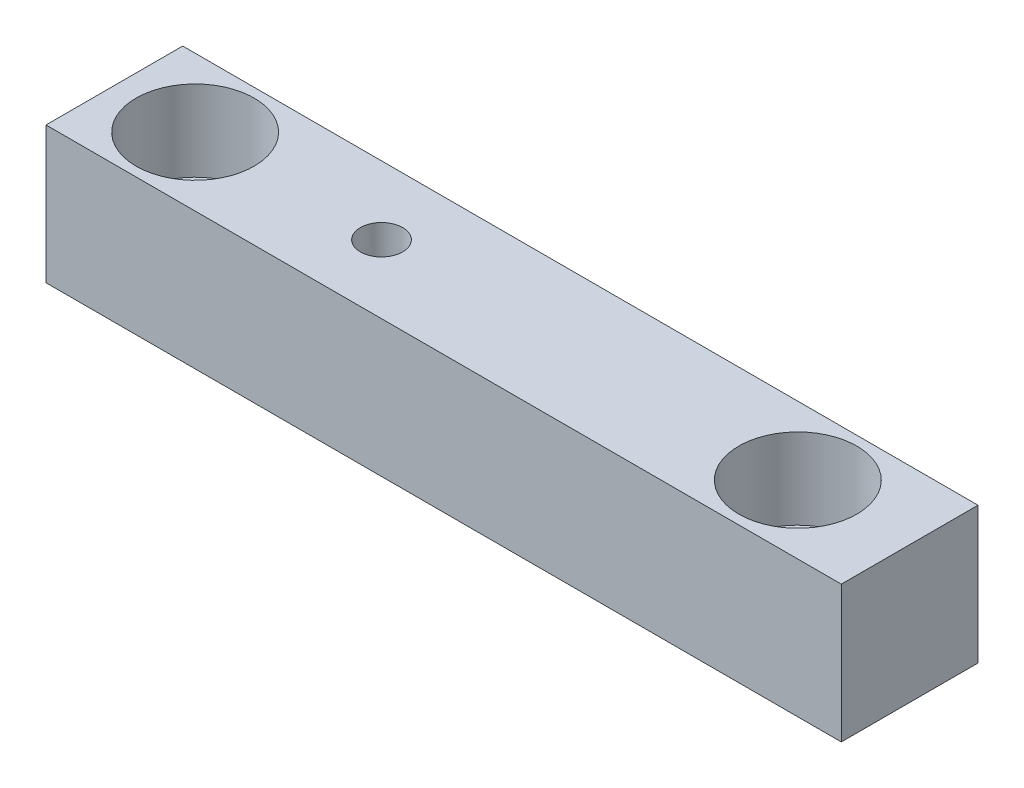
ISO-10303-21;
HEADER;
FILE_DESCRIPTION(('STEP AP214'),'2;1');
FILE_NAME('part.step','',(''),(''),'','','');
FILE_SCHEMA(('AUTOMOTIVE_DESIGN { 1 0 10303 214 1 1 1 1 }'));
ENDSEC;
DATA;
#1=APPLICATION_CONTEXT('core data for automotive mechanical design processes');
#2=APPLICATION_PROTOCOL_DEFINITION('international standard','automotive_design',2000,#1);
#3=PRODUCT_CONTEXT('',#1,'mechanical');
#4=PRODUCT('Part','Part','',(#3));
#5=PRODUCT_RELATED_PRODUCT_CATEGORY('part','',(#4));
#6=PRODUCT_DEFINITION_FORMATION('','',#4);
#7=PRODUCT_DEFINITION_CONTEXT('part definition',#1,'design');
#8=PRODUCT_DEFINITION('design','',#6,#7);
#9=PRODUCT_DEFINITION_SHAPE('','',#8);
#10=(LENGTH_UNIT() NAMED_UNIT(*) SI_UNIT(.MILLI.,.METRE.));
#11=(NAMED_UNIT(*) PLANE_ANGLE_UNIT() SI_UNIT($,.RADIAN.));
#12=(NAMED_UNIT(*) SI_UNIT($,.STERADIAN.) SOLID_ANGLE_UNIT());
#13=UNCERTAINTY_MEASURE_WITH_UNIT(LENGTH_MEASURE(1.E-05),#10,'distance_accuracy_value','');
#14=(GEOMETRIC_REPRESENTATION_CONTEXT(3) GLOBAL_UNCERTAINTY_ASSIGNED_CONTEXT((#13)) GLOBAL_UNIT_ASSIGNED_CONTEXT((#10,
#11,#12)) REPRESENTATION_CONTEXT('',''));
#15=CARTESIAN_POINT('',(0.,0.,0.));
#16=DIRECTION('',(0.,0.,1.));
#17=DIRECTION('',(1.,0.,0.));
#18=AXIS2_PLACEMENT_3D('',#15,#16,#17);
#19=CARTESIAN_POINT('',(110.,0.,11.));
#20=DIRECTION('',(0.,1.,0.));
#21=DIRECTION('',(0.,0.,1.));
#22=AXIS2_PLACEMENT_3D('',#19,#20,#21);
#23=CYLINDRICAL_SURFACE('',#22,6.25);
#24=CARTESIAN_POINT('',(110.,0.,11.));
#25=DIRECTION('',(0.,1.,0.));
#26=DIRECTION('',(0.,0.,1.));
#27=AXIS2_PLACEMENT_3D('',#24,#25,#26);
#28=CIRCLE('',#27,6.25);
#29=CARTESIAN_POINT('',(110.,0.,17.25));
#30=VERTEX_POINT('',#29);
#31=EDGE_CURVE('E114',#30,#30,#28,.T.);
#32=ORIENTED_EDGE('',*,*,#31,.F.);
#33=EDGE_LOOP('',(#32));
#34=FACE_BOUND('',#33,.T.);
#35=CARTESIAN_POINT('',(110.,9.,11.));
#36=DIRECTION('',(0.,1.,0.));
#37=DIRECTION('',(0.,0.,1.));
#38=AXIS2_PLACEMENT_3D('',#35,#36,#37);
#39=CIRCLE('',#38,6.25);
#40=CARTESIAN_POINT('',(110.,9.,17.25));
#41=VERTEX_POINT('',#40);
#42=EDGE_CURVE('E41',#41,#41,#39,.F.);
#43=ORIENTED_EDGE('',*,*,#42,.F.);
#44=EDGE_LOOP('',(#43));
#45=FACE_BOUND('',#44,.T.);
#46=ADVANCED_FACE('F37',(#34,#45),#23,.F.);
#47=CARTESIAN_POINT('',(13.,0.,11.));
#48=DIRECTION('',(0.,1.,0.));
#49=DIRECTION('',(0.,0.,1.));
#50=AXIS2_PLACEMENT_3D('',#47,#48,#49);
#51=CYLINDRICAL_SURFACE('',#50,6.25);
#52=CARTESIAN_POINT('',(13.,0.,11.));
#53=DIRECTION('',(0.,1.,0.));
#54=DIRECTION('',(0.,0.,1.));
#55=AXIS2_PLACEMENT_3D('',#52,#53,#54);
#56=CIRCLE('',#55,6.25);
#57=CARTESIAN_POINT('',(13.,0.,17.25));
#58=VERTEX_POINT('',#57);
#59=EDGE_CURVE('E107',#58,#58,#56,.T.);
#60=ORIENTED_EDGE('',*,*,#59,.F.);
#61=EDGE_LOOP('',(#60));
#62=FACE_BOUND('',#61,.T.);
#63=CARTESIAN_POINT('',(13.,9.,11.));
#64=DIRECTION('',(0.,1.,0.));
#65=DIRECTION('',(0.,0.,1.));
#66=AXIS2_PLACEMENT_3D('',#63,#64,#65);
#67=CIRCLE('',#66,6.25);
#68=CARTESIAN_POINT('',(13.,9.,17.25));
#69=VERTEX_POINT('',#68);
#70=EDGE_CURVE('E112',#69,#69,#67,.F.);
#71=ORIENTED_EDGE('',*,*,#70,.F.);
#72=EDGE_LOOP('',(#71));
#73=FACE_BOUND('',#72,.T.);
#74=ADVANCED_FACE('F135',(#62,#73),#51,.F.);
#75=CARTESIAN_POINT('',(0.,0.,22.));
#76=DIRECTION('',(1.,0.,0.));
#77=DIRECTION('',(0.,0.,-1.));
#78=AXIS2_PLACEMENT_3D('',#75,#76,#77);
#79=PLANE('',#78);
#80=DIRECTION('',(0.,-1.,0.));
#81=VECTOR('',#80,1.);
#82=CARTESIAN_POINT('',(0.,0.,0.));
#83=LINE('',#82,#81);
#84=CARTESIAN_POINT('',(0.,22.,0.));
#85=VERTEX_POINT('',#84);
#86=CARTESIAN_POINT('',(0.,0.,0.));
#87=VERTEX_POINT('',#86);
#88=EDGE_CURVE('E104',#85,#87,#83,.T.);
#89=ORIENTED_EDGE('',*,*,#88,.T.);
#90=DIRECTION('',(0.,0.,-1.));
#91=VECTOR('',#90,1.);
#92=CARTESIAN_POINT('',(0.,0.,22.));
#93=LINE('',#92,#91);
#94=CARTESIAN_POINT('',(0.,0.,22.));
#95=VERTEX_POINT('',#94);
#96=EDGE_CURVE('E11',#95,#87,#93,.T.);
#97=ORIENTED_EDGE('',*,*,#96,.F.);
#98=DIRECTION('',(0.,-1.,0.));
#99=VECTOR('',#98,1.);
#100=CARTESIAN_POINT('',(0.,0.,22.));
#101=LINE('',#100,#99);
#102=CARTESIAN_POINT('',(0.,22.,22.));
#103=VERTEX_POINT('',#102);
#104=EDGE_CURVE('E91',#103,#95,#101,.T.);
#105=ORIENTED_EDGE('',*,*,#104,.F.);
#106=DIRECTION('',(0.,0.,-1.));
#107=VECTOR('',#106,1.);
#108=CARTESIAN_POINT('',(0.,22.,22.));
#109=LINE('',#108,#107);
#110=EDGE_CURVE('E100',#103,#85,#109,.T.);
#111=ORIENTED_EDGE('',*,*,#110,.T.);
#112=EDGE_LOOP('',(#89,#97,#105,#111));
#113=FACE_BOUND('',#112,.T.);
#114=ADVANCED_FACE('F39',(#113),#79,.F.);
#115=CARTESIAN_POINT('',(0.,0.,22.));
#116=DIRECTION('',(0.,1.,0.));
#117=DIRECTION('',(0.,0.,1.));
#118=AXIS2_PLACEMENT_3D('',#115,#116,#117);
#119=PLANE('',#118);
#120=CARTESIAN_POINT('',(43.,0.,11.));
#121=DIRECTION('',(0.,1.,0.));
#122=DIRECTION('',(0.,0.,1.));
#123=AXIS2_PLACEMENT_3D('',#120,#121,#122);
#124=CIRCLE('',#123,3.39999999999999);
#125=CARTESIAN_POINT('',(43.,0.,14.4));
#126=VERTEX_POINT('',#125);
#127=EDGE_CURVE('E167',#126,#126,#124,.T.);
#128=ORIENTED_EDGE('',*,*,#127,.T.);
#129=EDGE_LOOP('',(#128));
#130=FACE_BOUND('',#129,.T.);
#131=ORIENTED_EDGE('',*,*,#31,.T.);
#132=EDGE_LOOP('',(#131));
#133=FACE_BOUND('',#132,.T.);
#134=ORIENTED_EDGE('',*,*,#59,.T.);
#135=EDGE_LOOP('',(#134));
#136=FACE_BOUND('',#135,.T.);
#137=DIRECTION('',(1.,0.,0.));
#138=VECTOR('',#137,1.);
#139=CARTESIAN_POINT('',(0.,0.,0.));
#140=LINE('',#139,#138);
#141=CARTESIAN_POINT('',(128.,0.,0.));
#142=VERTEX_POINT('',#141);
#143=EDGE_CURVE('E95',#87,#142,#140,.T.);
#144=ORIENTED_EDGE('',*,*,#143,.T.);
#145=DIRECTION('',(0.,0.,-1.));
#146=VECTOR('',#145,1.);
#147=CARTESIAN_POINT('',(128.,0.,22.));
#148=LINE('',#147,#146);
#149=CARTESIAN_POINT('',(128.,0.,22.));
#150=VERTEX_POINT('',#149);
#151=EDGE_CURVE('E47',#150,#142,#148,.T.);
#152=ORIENTED_EDGE('',*,*,#151,.F.);
#153=DIRECTION('',(1.,0.,0.));
#154=VECTOR('',#153,1.);
#155=CARTESIAN_POINT('',(0.,0.,22.));
#156=LINE('',#155,#154);
#157=EDGE_CURVE('E86',#95,#150,#156,.T.);
#158=ORIENTED_EDGE('',*,*,#157,.F.);
#159=ORIENTED_EDGE('',*,*,#96,.T.);
#160=EDGE_LOOP('',(#144,#152,#158,#159));
#161=FACE_BOUND('',#160,.T.);
#162=ADVANCED_FACE('F94',(#130,#133,#136,#161),#119,.F.);
#163=CARTESIAN_POINT('',(128.,0.,22.));
#164=DIRECTION('',(-1.,0.,0.));
#165=DIRECTION('',(0.,0.,1.));
#166=AXIS2_PLACEMENT_3D('',#163,#164,#165);
#167=PLANE('',#166);
#168=DIRECTION('',(0.,1.,0.));
#169=VECTOR('',#168,1.);
#170=CARTESIAN_POINT('',(128.,0.,0.));
#171=LINE('',#170,#169);
#172=CARTESIAN_POINT('',(128.,22.,0.));
#173=VERTEX_POINT('',#172);
#174=EDGE_CURVE('E73',#142,#173,#171,.T.);
#175=ORIENTED_EDGE('',*,*,#174,.T.);
#176=DIRECTION('',(0.,0.,-1.));
#177=VECTOR('',#176,1.);
#178=CARTESIAN_POINT('',(128.,22.,22.));
#179=LINE('',#178,#177);
#180=CARTESIAN_POINT('',(128.,22.,22.));
#181=VERTEX_POINT('',#180);
#182=EDGE_CURVE('E96',#181,#173,#179,.T.);
#183=ORIENTED_EDGE('',*,*,#182,.F.);
#184=DIRECTION('',(0.,1.,0.));
#185=VECTOR('',#184,1.);
#186=CARTESIAN_POINT('',(128.,0.,22.));
#187=LINE('',#186,#185);
#188=EDGE_CURVE('E89',#150,#181,#187,.T.);
#189=ORIENTED_EDGE('',*,*,#188,.F.);
#190=ORIENTED_EDGE('',*,*,#151,.T.);
#191=EDGE_LOOP('',(#175,#183,#189,#190));
#192=FACE_BOUND('',#191,.T.);
#193=ADVANCED_FACE('F98',(#192),#167,.F.);
#194=CARTESIAN_POINT('',(0.,22.,22.));
#195=DIRECTION('',(0.,-1.,0.));
#196=DIRECTION('',(0.,0.,-1.));
#197=AXIS2_PLACEMENT_3D('',#194,#195,#196);
#198=PLANE('',#197);
#199=CARTESIAN_POINT('',(43.,22.,11.));
#200=DIRECTION('',(0.,1.,0.));
#201=DIRECTION('',(0.,0.,1.));
#202=AXIS2_PLACEMENT_3D('',#199,#200,#201);
#203=CIRCLE('',#202,3.4);
#204=CARTESIAN_POINT('',(43.,22.,14.4));
#205=VERTEX_POINT('',#204);
#206=EDGE_CURVE('E180',#205,#205,#203,.T.);
#207=ORIENTED_EDGE('',*,*,#206,.F.);
#208=EDGE_LOOP('',(#207));
#209=FACE_BOUND('',#208,.T.);
#210=CARTESIAN_POINT('',(110.,22.,11.));
#211=DIRECTION('',(0.,1.,0.));
#212=DIRECTION('',(0.,0.,1.));
#213=AXIS2_PLACEMENT_3D('',#210,#211,#212);
#214=CIRCLE('',#213,9.5);
#215=CARTESIAN_POINT('',(110.,22.,20.5));
#216=VERTEX_POINT('',#215);
#217=EDGE_CURVE('E128',#216,#216,#214,.T.);
#218=ORIENTED_EDGE('',*,*,#217,.F.);
#219=EDGE_LOOP('',(#218));
#220=FACE_BOUND('',#219,.T.);
#221=CARTESIAN_POINT('',(13.,22.,11.));
#222=DIRECTION('',(0.,1.,0.));
#223=DIRECTION('',(0.,0.,1.));
#224=AXIS2_PLACEMENT_3D('',#221,#222,#223);
#225=CIRCLE('',#224,9.5);
#226=CARTESIAN_POINT('',(13.,22.,20.5));
#227=VERTEX_POINT('',#226);
#228=EDGE_CURVE('E121',#227,#227,#225,.T.);
#229=ORIENTED_EDGE('',*,*,#228,.F.);
#230=EDGE_LOOP('',(#229));
#231=FACE_BOUND('',#230,.T.);
#232=DIRECTION('',(-1.,0.,0.));
#233=VECTOR('',#232,1.);
#234=CARTESIAN_POINT('',(0.,22.,0.));
#235=LINE('',#234,#233);
#236=EDGE_CURVE('E79',#173,#85,#235,.T.);
#237=ORIENTED_EDGE('',*,*,#236,.T.);
#238=ORIENTED_EDGE('',*,*,#110,.F.);
#239=DIRECTION('',(-1.,0.,0.));
#240=VECTOR('',#239,1.);
#241=CARTESIAN_POINT('',(0.,22.,22.));
#242=LINE('',#241,#240);
#243=EDGE_CURVE('E56',#181,#103,#242,.T.);
#244=ORIENTED_EDGE('',*,*,#243,.F.);
#245=ORIENTED_EDGE('',*,*,#182,.T.);
#246=EDGE_LOOP('',(#237,#238,#244,#245));
#247=FACE_BOUND('',#246,.T.);
#248=ADVANCED_FACE('F151',(#209,#220,#231,#247),#198,.F.);
#249=CARTESIAN_POINT('',(0.,0.,22.));
#250=DIRECTION('',(0.,0.,-1.));
#251=DIRECTION('',(-1.,0.,0.));
#252=AXIS2_PLACEMENT_3D('',#249,#250,#251);
#253=PLANE('',#252);
#254=ORIENTED_EDGE('',*,*,#104,.T.);
#255=ORIENTED_EDGE('',*,*,#157,.T.);
#256=ORIENTED_EDGE('',*,*,#188,.T.);
#257=ORIENTED_EDGE('',*,*,#243,.T.);
#258=EDGE_LOOP('',(#254,#255,#256,#257));
#259=FACE_BOUND('',#258,.T.);
#260=ADVANCED_FACE('F87',(#259),#253,.F.);
#261=CARTESIAN_POINT('',(0.,0.,0.));
#262=DIRECTION('',(0.,0.,-1.));
#263=DIRECTION('',(-1.,0.,0.));
#264=AXIS2_PLACEMENT_3D('',#261,#262,#263);
#265=PLANE('',#264);
#266=ORIENTED_EDGE('',*,*,#88,.F.);
#267=ORIENTED_EDGE('',*,*,#236,.F.);
#268=ORIENTED_EDGE('',*,*,#174,.F.);
#269=ORIENTED_EDGE('',*,*,#143,.F.);
#270=EDGE_LOOP('',(#266,#267,#268,#269));
#271=FACE_BOUND('',#270,.T.);
#272=ADVANCED_FACE('F150',(#271),#265,.T.);
#273=CARTESIAN_POINT('',(13.,9.,11.));
#274=DIRECTION('',(0.,1.,0.));
#275=DIRECTION('',(0.,0.,1.));
#276=AXIS2_PLACEMENT_3D('',#273,#274,#275);
#277=PLANE('',#276);
#278=CARTESIAN_POINT('',(13.,9.,11.));
#279=DIRECTION('',(0.,1.,0.));
#280=DIRECTION('',(0.,0.,1.));
#281=AXIS2_PLACEMENT_3D('',#278,#279,#280);
#282=CIRCLE('',#281,9.5);
#283=CARTESIAN_POINT('',(13.,9.,20.5));
#284=VERTEX_POINT('',#283);
#285=EDGE_CURVE('E115',#284,#284,#282,.T.);
#286=ORIENTED_EDGE('',*,*,#285,.T.);
#287=EDGE_LOOP('',(#286));
#288=FACE_BOUND('',#287,.T.);
#289=ORIENTED_EDGE('',*,*,#70,.T.);
#290=EDGE_LOOP('',(#289));
#291=FACE_BOUND('',#290,.T.);
#292=ADVANCED_FACE('F154',(#288,#291),#277,.T.);
#293=CARTESIAN_POINT('',(13.,9.,11.));
#294=DIRECTION('',(0.,1.,0.));
#295=DIRECTION('',(0.,0.,1.));
#296=AXIS2_PLACEMENT_3D('',#293,#294,#295);
#297=CYLINDRICAL_SURFACE('',#296,9.5);
#298=CARTESIAN_POINT('',(13.,9.,20.5));
#299=CARTESIAN_POINT('',(13.,9.13541666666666,20.5));
#300=CARTESIAN_POINT('',(13.,9.27083333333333,20.5));
#301=CARTESIAN_POINT('',(13.,9.54166666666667,20.5));
#302=CARTESIAN_POINT('',(13.,9.67708333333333,20.5));
#303=CARTESIAN_POINT('',(13.,9.94791666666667,20.5));
#304=CARTESIAN_POINT('',(13.,10.0833333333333,20.5));
#305=CARTESIAN_POINT('',(13.,10.3541666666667,20.5));
#306=CARTESIAN_POINT('',(13.,10.4895833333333,20.5));
#307=CARTESIAN_POINT('',(13.,10.7604166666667,20.5));
#308=CARTESIAN_POINT('',(13.,10.8958333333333,20.5));
#309=CARTESIAN_POINT('',(13.,11.1666666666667,20.5));
#310=CARTESIAN_POINT('',(13.,11.3020833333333,20.5));
#311=CARTESIAN_POINT('',(13.,11.5729166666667,20.5));
#312=CARTESIAN_POINT('',(13.,11.7083333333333,20.5));
#313=CARTESIAN_POINT('',(13.,11.9791666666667,20.5));
#314=CARTESIAN_POINT('',(13.,12.1145833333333,20.5));
#315=CARTESIAN_POINT('',(13.,12.3854166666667,20.5));
#316=CARTESIAN_POINT('',(13.,12.5208333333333,20.5));
#317=CARTESIAN_POINT('',(13.,12.7916666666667,20.5));
#318=CARTESIAN_POINT('',(13.,12.9270833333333,20.5));
#319=CARTESIAN_POINT('',(13.,13.1979166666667,20.5));
#320=CARTESIAN_POINT('',(13.,13.3333333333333,20.5));
#321=CARTESIAN_POINT('',(13.,13.6041666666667,20.5));
#322=CARTESIAN_POINT('',(13.,13.7395833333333,20.5));
#323=CARTESIAN_POINT('',(13.,14.0104166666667,20.5));
#324=CARTESIAN_POINT('',(13.,14.1458333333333,20.5));
#325=CARTESIAN_POINT('',(13.,14.4166666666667,20.5));
#326=CARTESIAN_POINT('',(13.,14.5520833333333,20.5));
#327=CARTESIAN_POINT('',(13.,14.8229166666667,20.5));
#328=CARTESIAN_POINT('',(13.,14.9583333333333,20.5));
#329=CARTESIAN_POINT('',(13.,15.2291666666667,20.5));
#330=CARTESIAN_POINT('',(13.,15.3645833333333,20.5));
#331=CARTESIAN_POINT('',(13.,15.6354166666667,20.5));
#332=CARTESIAN_POINT('',(13.,15.7708333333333,20.5));
#333=CARTESIAN_POINT('',(13.,16.0416666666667,20.5));
#334=CARTESIAN_POINT('',(13.,16.1770833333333,20.5));
#335=CARTESIAN_POINT('',(13.,16.4479166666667,20.5));
#336=CARTESIAN_POINT('',(13.,16.5833333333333,20.5));
#337=CARTESIAN_POINT('',(13.,16.8541666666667,20.5));
#338=CARTESIAN_POINT('',(13.,16.9895833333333,20.5));
#339=CARTESIAN_POINT('',(13.,17.2604166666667,20.5));
#340=CARTESIAN_POINT('',(13.,17.3958333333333,20.5));
#341=CARTESIAN_POINT('',(13.,17.6666666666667,20.5));
#342=CARTESIAN_POINT('',(13.,17.8020833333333,20.5));
#343=CARTESIAN_POINT('',(13.,18.0729166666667,20.5));
#344=CARTESIAN_POINT('',(13.,18.2083333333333,20.5));
#345=CARTESIAN_POINT('',(13.,18.4791666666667,20.5));
#346=CARTESIAN_POINT('',(13.,18.6145833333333,20.5));
#347=CARTESIAN_POINT('',(13.,18.8854166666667,20.5));
#348=CARTESIAN_POINT('',(13.,19.0208333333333,20.5));
#349=CARTESIAN_POINT('',(13.,19.2916666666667,20.5));
#350=CARTESIAN_POINT('',(13.,19.4270833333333,20.5));
#351=CARTESIAN_POINT('',(13.,19.6979166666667,20.5));
#352=CARTESIAN_POINT('',(13.,19.8333333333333,20.5));
#353=CARTESIAN_POINT('',(13.,20.1041666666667,20.5));
#354=CARTESIAN_POINT('',(13.,20.2395833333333,20.5));
#355=CARTESIAN_POINT('',(13.,20.5104166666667,20.5));
#356=CARTESIAN_POINT('',(13.,20.6458333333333,20.5));
#357=CARTESIAN_POINT('',(13.,20.9166666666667,20.5));
#358=CARTESIAN_POINT('',(13.,21.0520833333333,20.5));
#359=CARTESIAN_POINT('',(13.,21.3229166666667,20.5));
#360=CARTESIAN_POINT('',(13.,21.4583333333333,20.5));
#361=CARTESIAN_POINT('',(13.,21.7291666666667,20.5));
#362=CARTESIAN_POINT('',(13.,21.8645833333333,20.5));
#363=CARTESIAN_POINT('',(13.,22.,20.5));
#364=B_SPLINE_CURVE_WITH_KNOTS('',3,(#298,#299,#300,#301,#302,#303,#304,#305,#306,#307,#308,
#309,#310,#311,#312,#313,#314,#315,#316,#317,#318,#319,#320,#321,#322,#323,#324,#325,#326,#327,
#328,#329,#330,#331,#332,#333,#334,#335,#336,#337,#338,#339,#340,#341,#342,#343,#344,#345,#346,
#347,#348,#349,#350,#351,#352,#353,#354,#355,#356,#357,#358,#359,#360,#361,#362,#363),
.UNSPECIFIED.,.F.,.F.,(4,2,2,2,2,2,2,2,2,2,2,2,2,2,2,2,2,2,2,2,2,2,2,2,2,2,2,2,2,2,2,2,4),(0.,
0.406249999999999,0.812499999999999,1.21875,1.625,2.03125,2.4375,2.84375,3.25,3.65625,4.0625,
4.46875,4.875,5.28125,5.6875,6.09375,6.5,6.90625,7.3125,7.71875,8.12499999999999,8.53125,8.9375,
9.34375,9.75,10.15625,10.5625,10.96875,11.375,11.78125,12.1875,12.59375,13.),.UNSPECIFIED.);
#365=EDGE_CURVE('BSEAM190',#284,#227,#364,.T.);
#366=ORIENTED_EDGE('',*,*,#285,.F.);
#367=ORIENTED_EDGE('',*,*,#228,.T.);
#368=ORIENTED_EDGE('',*,*,#365,.T.);
#369=ORIENTED_EDGE('',*,*,#365,.F.);
#370=EDGE_LOOP('',(#366,#368,#367,#369));
#371=FACE_BOUND('',#370,.T.);
#372=ADVANCED_FACE('F190',(#371),#297,.F.);
#373=CARTESIAN_POINT('',(110.,9.,11.));
#374=DIRECTION('',(0.,1.,0.));
#375=DIRECTION('',(0.,0.,1.));
#376=AXIS2_PLACEMENT_3D('',#373,#374,#375);
#377=PLANE('',#376);
#378=CARTESIAN_POINT('',(110.,9.,11.));
#379=DIRECTION('',(0.,1.,0.));
#380=DIRECTION('',(0.,0.,1.));
#381=AXIS2_PLACEMENT_3D('',#378,#379,#380);
#382=CIRCLE('',#381,9.5);
#383=CARTESIAN_POINT('',(110.,9.,20.5));
#384=VERTEX_POINT('',#383);
#385=EDGE_CURVE('E173',#384,#384,#382,.T.);
#386=ORIENTED_EDGE('',*,*,#385,.T.);
#387=EDGE_LOOP('',(#386));
#388=FACE_BOUND('',#387,.T.);
#389=ORIENTED_EDGE('',*,*,#42,.T.);
#390=EDGE_LOOP('',(#389));
#391=FACE_BOUND('',#390,.T.);
#392=ADVANCED_FACE('F192',(#388,#391),#377,.T.);
#393=CARTESIAN_POINT('',(110.,9.,11.));
#394=DIRECTION('',(0.,1.,0.));
#395=DIRECTION('',(0.,0.,1.));
#396=AXIS2_PLACEMENT_3D('',#393,#394,#395);
#397=CYLINDRICAL_SURFACE('',#396,9.5);
#398=CARTESIAN_POINT('',(110.,9.,20.5));
#399=CARTESIAN_POINT('',(110.,9.13541666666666,20.5));
#400=CARTESIAN_POINT('',(110.,9.27083333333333,20.5));
#401=CARTESIAN_POINT('',(110.,9.54166666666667,20.5));
#402=CARTESIAN_POINT('',(110.,9.67708333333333,20.5));
#403=CARTESIAN_POINT('',(110.,9.94791666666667,20.5));
#404=CARTESIAN_POINT('',(110.,10.0833333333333,20.5));
#405=CARTESIAN_POINT('',(110.,10.3541666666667,20.5));
#406=CARTESIAN_POINT('',(110.,10.4895833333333,20.5));
#407=CARTESIAN_POINT('',(110.,10.7604166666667,20.5));
#408=CARTESIAN_POINT('',(110.,10.8958333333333,20.5));
#409=CARTESIAN_POINT('',(110.,11.1666666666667,20.5));
#410=CARTESIAN_POINT('',(110.,11.3020833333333,20.5));
#411=CARTESIAN_POINT('',(110.,11.5729166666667,20.5));
#412=CARTESIAN_POINT('',(110.,11.7083333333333,20.5));
#413=CARTESIAN_POINT('',(110.,11.9791666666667,20.5));
#414=CARTESIAN_POINT('',(110.,12.1145833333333,20.5));
#415=CARTESIAN_POINT('',(110.,12.3854166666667,20.5));
#416=CARTESIAN_POINT('',(110.,12.5208333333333,20.5));
#417=CARTESIAN_POINT('',(110.,12.7916666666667,20.5));
#418=CARTESIAN_POINT('',(110.,12.9270833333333,20.5));
#419=CARTESIAN_POINT('',(110.,13.1979166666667,20.5));
#420=CARTESIAN_POINT('',(110.,13.3333333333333,20.5));
#421=CARTESIAN_POINT('',(110.,13.6041666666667,20.5));
#422=CARTESIAN_POINT('',(110.,13.7395833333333,20.5));
#423=CARTESIAN_POINT('',(110.,14.0104166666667,20.5));
#424=CARTESIAN_POINT('',(110.,14.1458333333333,20.5));
#425=CARTESIAN_POINT('',(110.,14.4166666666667,20.5));
#426=CARTESIAN_POINT('',(110.,14.5520833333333,20.5));
#427=CARTESIAN_POINT('',(110.,14.8229166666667,20.5));
#428=CARTESIAN_POINT('',(110.,14.9583333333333,20.5));
#429=CARTESIAN_POINT('',(110.,15.2291666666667,20.5));
#430=CARTESIAN_POINT('',(110.,15.3645833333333,20.5));
#431=CARTESIAN_POINT('',(110.,15.6354166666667,20.5));
#432=CARTESIAN_POINT('',(110.,15.7708333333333,20.5));
#433=CARTESIAN_POINT('',(110.,16.0416666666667,20.5));
#434=CARTESIAN_POINT('',(110.,16.1770833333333,20.5));
#435=CARTESIAN_POINT('',(110.,16.4479166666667,20.5));
#436=CARTESIAN_POINT('',(110.,16.5833333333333,20.5));
#437=CARTESIAN_POINT('',(110.,16.8541666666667,20.5));
#438=CARTESIAN_POINT('',(110.,16.9895833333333,20.5));
#439=CARTESIAN_POINT('',(110.,17.2604166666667,20.5));
#440=CARTESIAN_POINT('',(110.,17.3958333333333,20.5));
#441=CARTESIAN_POINT('',(110.,17.6666666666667,20.5));
#442=CARTESIAN_POINT('',(110.,17.8020833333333,20.5));
#443=CARTESIAN_POINT('',(110.,18.0729166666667,20.5));
#444=CARTESIAN_POINT('',(110.,18.2083333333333,20.5));
#445=CARTESIAN_POINT('',(110.,18.4791666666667,20.5));
#446=CARTESIAN_POINT('',(110.,18.6145833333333,20.5));
#447=CARTESIAN_POINT('',(110.,18.8854166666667,20.5));
#448=CARTESIAN_POINT('',(110.,19.0208333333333,20.5));
#449=CARTESIAN_POINT('',(110.,19.2916666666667,20.5));
#450=CARTESIAN_POINT('',(110.,19.4270833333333,20.5));
#451=CARTESIAN_POINT('',(110.,19.6979166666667,20.5));
#452=CARTESIAN_POINT('',(110.,19.8333333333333,20.5));
#453=CARTESIAN_POINT('',(110.,20.1041666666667,20.5));
#454=CARTESIAN_POINT('',(110.,20.2395833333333,20.5));
#455=CARTESIAN_POINT('',(110.,20.5104166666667,20.5));
#456=CARTESIAN_POINT('',(110.,20.6458333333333,20.5));
#457=CARTESIAN_POINT('',(110.,20.9166666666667,20.5));
#458=CARTESIAN_POINT('',(110.,21.0520833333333,20.5));
#459=CARTESIAN_POINT('',(110.,21.3229166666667,20.5));
#460=CARTESIAN_POINT('',(110.,21.4583333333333,20.5));
#461=CARTESIAN_POINT('',(110.,21.7291666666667,20.5));
#462=CARTESIAN_POINT('',(110.,21.8645833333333,20.5));
#463=CARTESIAN_POINT('',(110.,22.,20.5));
#464=B_SPLINE_CURVE_WITH_KNOTS('',3,(#398,#399,#400,#401,#402,#403,#404,#405,#406,#407,#408,
#409,#410,#411,#412,#413,#414,#415,#416,#417,#418,#419,#420,#421,#422,#423,#424,#425,#426,#427,
#428,#429,#430,#431,#432,#433,#434,#435,#436,#437,#438,#439,#440,#441,#442,#443,#444,#445,#446,
#447,#448,#449,#450,#451,#452,#453,#454,#455,#456,#457,#458,#459,#460,#461,#462,#463),
.UNSPECIFIED.,.F.,.F.,(4,2,2,2,2,2,2,2,2,2,2,2,2,2,2,2,2,2,2,2,2,2,2,2,2,2,2,2,2,2,2,2,4),(0.,
0.406249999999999,0.812499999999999,1.21875,1.625,2.03125,2.4375,2.84375,3.25,3.65625,4.0625,
4.46875,4.875,5.28125,5.6875,6.09375,6.5,6.90625,7.3125,7.71875,8.12499999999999,8.53125,8.9375,
9.34375,9.75,10.15625,10.5625,10.96875,11.375,11.78125,12.1875,12.59375,13.),.UNSPECIFIED.);
#465=EDGE_CURVE('BSEAM198',#384,#216,#464,.T.);
#466=ORIENTED_EDGE('',*,*,#385,.F.);
#467=ORIENTED_EDGE('',*,*,#217,.T.);
#468=ORIENTED_EDGE('',*,*,#465,.T.);
#469=ORIENTED_EDGE('',*,*,#465,.F.);
#470=EDGE_LOOP('',(#466,#468,#467,#469));
#471=FACE_BOUND('',#470,.T.);
#472=ADVANCED_FACE('F198',(#471),#397,.F.);
#473=CARTESIAN_POINT('',(43.,22.,11.));
#474=DIRECTION('',(0.,1.,0.));
#475=DIRECTION('',(0.,0.,1.));
#476=AXIS2_PLACEMENT_3D('',#473,#474,#475);
#477=CYLINDRICAL_SURFACE('',#476,3.4);
#478=ORIENTED_EDGE('',*,*,#127,.F.);
#479=EDGE_LOOP('',(#478));
#480=FACE_BOUND('',#479,.T.);
#481=ORIENTED_EDGE('',*,*,#206,.T.);
#482=EDGE_LOOP('',(#481));
#483=FACE_BOUND('',#482,.T.);
#484=ADVANCED_FACE('F184',(#480,#483),#477,.F.);
#485=CLOSED_SHELL('',(#46,#74,#114,#162,#193,#248,#260,#272,#292,#372,#392,#472,#484));
#486=MANIFOLD_SOLID_BREP('B2',#485);
#487=ADVANCED_BREP_SHAPE_REPRESENTATION('',(#18,#486),#14);
#488=SHAPE_DEFINITION_REPRESENTATION(#9,#487);
ENDSEC;
END-ISO-10303-21;
